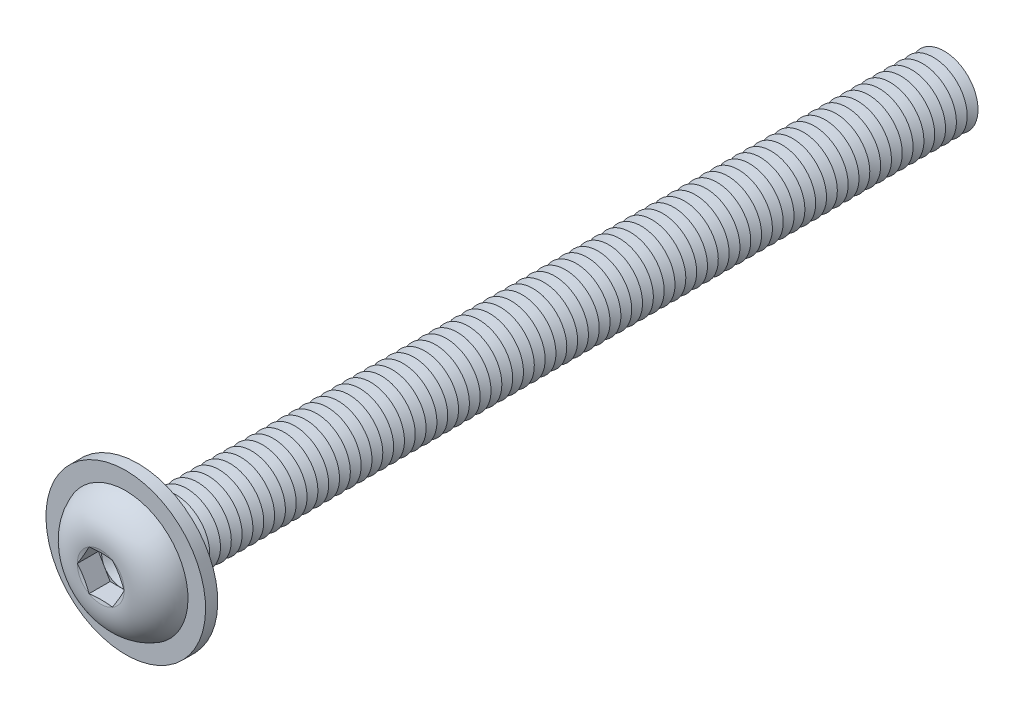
from build123d import *

# Parameters (mm, degrees)
FILLET1_R           = 0.4
LPATTERN1_COUNT     = 75
LPATTERN1_PITCH     = 0.8
CUT_EXTRUDE1_DEPTH  = 1.56
SKETCH5_R           = 5.9
SKETCH5_R_2         = 2.9
BOSS_EXTRUDE1_DEPTH = 0.9


with BuildPart() as part:
    # Sketch1 → Revolve1 (revolve)
    with BuildSketch(Plane(origin=(0, 0, 0), x_dir=(0, 0, -1), z_dir=(1, 0, 0))):
        with BuildLine():
            Line((0, 2.5), (0, 4.75))
            ThreePointArc((0, 4.75), (-2.041477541, 3.848329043), (-2.75, 1.73205))
            Line((-2.75, 1.73205), (-2.517949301, 0.866025))
            Line((-2.517949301, 0.866025), (-2.75, 0.866025))
            Line((-2.75, 0.866025), (-2.75, 0))
            Line((-2.75, 0), (60, 0))
            Line((60, 0), (60, 2.5))
            Line((60, 2.5), (0, 2.5))
        make_face()
    revolve(axis=Axis((0, 0, -60), (0, 0, 1)))

    # Fillet1
    fillet1_edges = [part.edges().sort_by_distance(p)[0] for p in [
        (0, -2.5, 0),
    ]]
    fillet(fillet1_edges, radius=FILLET1_R)

    # Sketch2 → Cut-Revolve1 (revolve, cut)
    with BuildSketch(Plane(origin=(0, 0, 0), x_dir=(0, 0, -1), z_dir=(1, 0, 0))):
        Polygon((59.6, 2.5), (60.4, 2.5), (60, 1.807179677), align=None)
    cut_revolve1 = revolve(axis=Axis((0, 0, -60), (0, 0, -1)), mode=Mode.SUBTRACT)

    # LPattern1: Cut-Revolve1 ×75
    with Locations(*[(0, 0, i * LPATTERN1_PITCH) for i in range(1, LPATTERN1_COUNT)]):
        add(cut_revolve1, mode=Mode.SUBTRACT)

    # Sketch3 → Cut-Extrude1 (cut)
    with BuildSketch(Plane.XY.offset(2.75)):
        Polygon((0.866025, 1.499999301), (-0.866025, 1.499999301), (-1.73205, 0), (-0.866025, -1.499999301), (0.866025, -1.499999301), (1.73205, 0), align=None)
    extrude(amount=-CUT_EXTRUDE1_DEPTH, mode=Mode.SUBTRACT)

    # Cut-Extrude2 cone 1 section (on through the dimple's axis) → Cut-Extrude2 (revolve, cut)
    with BuildSketch(Plane(origin=(0, 0, 1.19), x_dir=(0, -1, 0), z_dir=(1, 0, 0))):
        Polygon((0, 0), (1.499999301, 0), (0, 0.866025), align=None)
    revolve(axis=Axis((0, 0, 1.19), (0, 0, -1)), mode=Mode.SUBTRACT)

    # Sketch5 → Boss-Extrude1 (add)
    with BuildSketch(Plane(origin=(0, 0, 0), x_dir=(-1, 0, 0), z_dir=(0, 0, -1))):
        with Locations(Location((0, 0, 0), (0, 0, 90))):
            Circle(SKETCH5_R)
        Circle(SKETCH5_R_2, mode=Mode.SUBTRACT)
    extrude(amount=-BOSS_EXTRUDE1_DEPTH)


solid = part.part
